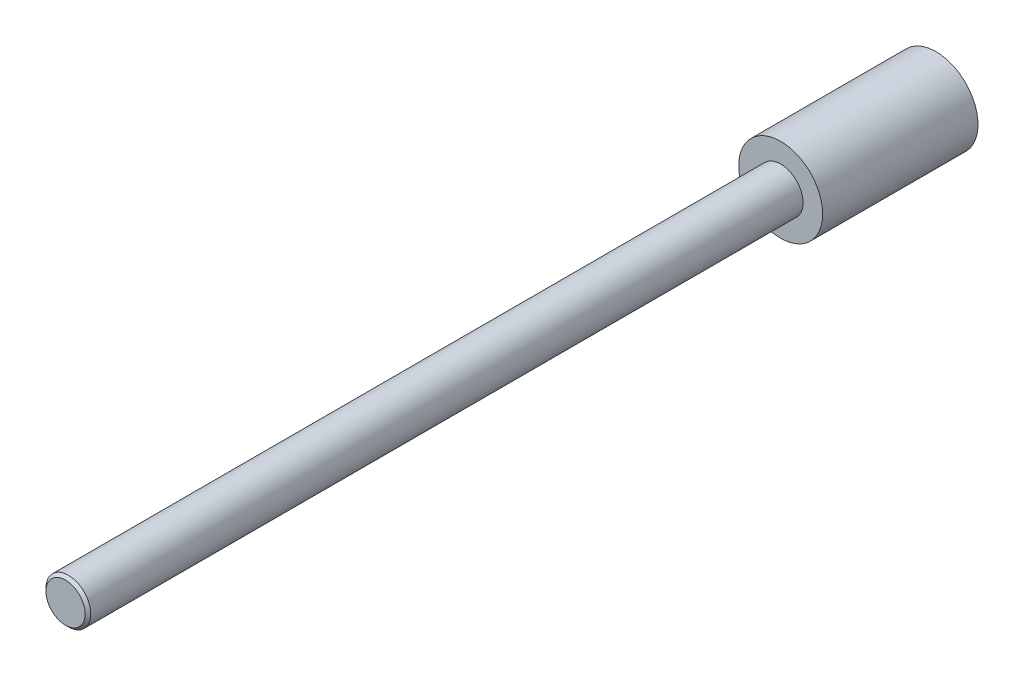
from build123d import *

# Parameters (mm, degrees)
SKETCH1_R           = 2.032
BASE_EXTRUDE_DEPTH  = 78.74
SKETCH2_R           = 3.81
BOSS_EXTRUDE1_DEPTH = 14.097
CHAMFER1_SIZE       = 0.254


with BuildPart() as part:
    # Sketch1 → Base-Extrude (new body)
    with BuildSketch(Plane.XY):
        Circle(SKETCH1_R)
    extrude(amount=BASE_EXTRUDE_DEPTH)

    # Sketch2 → Boss-Extrude1 (add)
    with BuildSketch(Plane.XY.offset(-0.254)):
        Circle(SKETCH2_R)
    extrude(amount=BOSS_EXTRUDE1_DEPTH)

    # Chamfer1
    chamfer1_edges = [part.edges().sort_by_distance(p)[0] for p in [
        (-2.032, 0, 78.74),
    ]]
    chamfer(chamfer1_edges, length=CHAMFER1_SIZE)


solid = part.part
